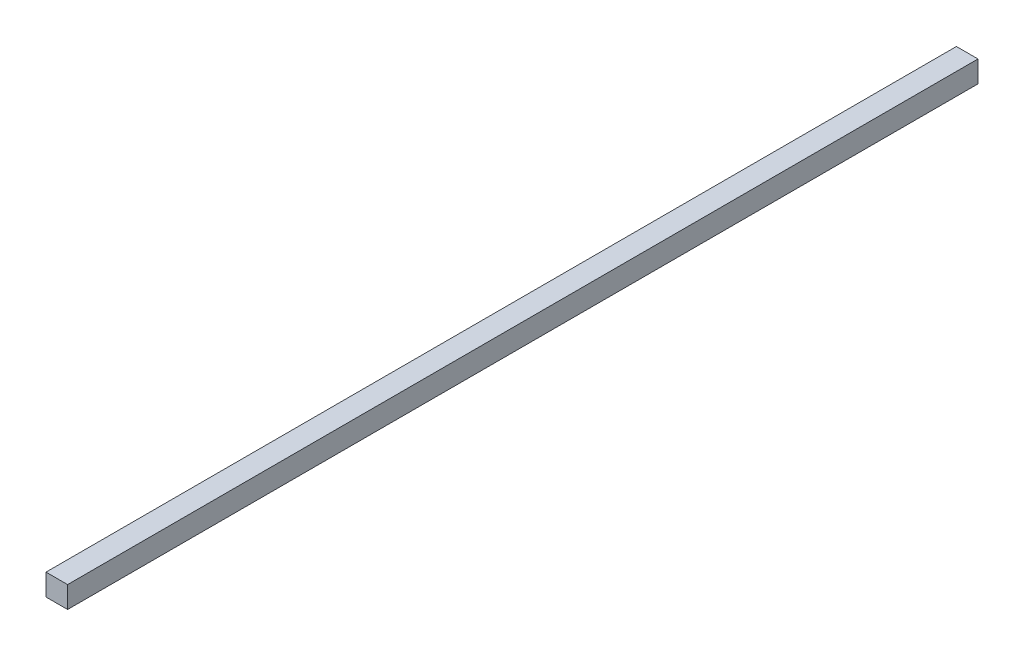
from build123d import *

# Parameters (mm, degrees)
SKETCH2_W           = 6.35
SKETCH2_H           = 6.35
BOSS_EXTRUDE1_DEPTH = 267.758


with BuildPart() as part:
    # Sketch2 → Boss-Extrude1 (new body)
    with BuildSketch(Plane.XY):
        with Locations((3.175, 3.175)):
            Rectangle(SKETCH2_W, SKETCH2_H)
    extrude(amount=BOSS_EXTRUDE1_DEPTH)


solid = part.part
